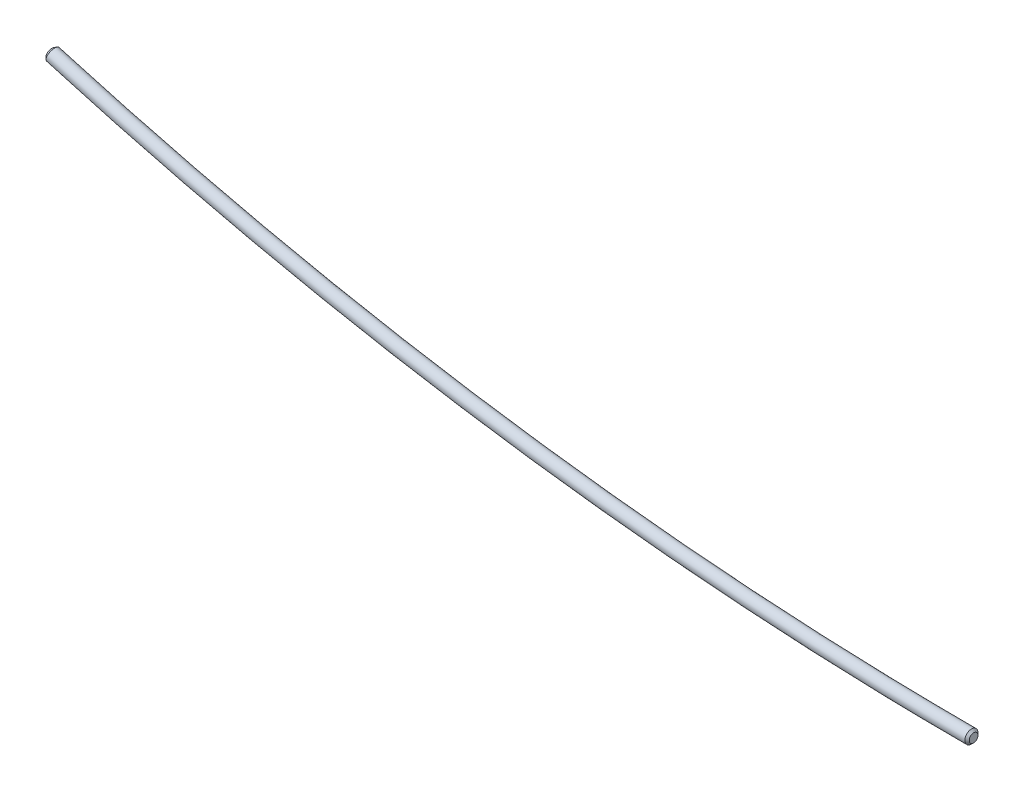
ISO-10303-21;
HEADER;
FILE_DESCRIPTION(('STEP AP214'),'2;1');
FILE_NAME('part.step','',(''),(''),'','','');
FILE_SCHEMA(('AUTOMOTIVE_DESIGN { 1 0 10303 214 1 1 1 1 }'));
ENDSEC;
DATA;
#1=APPLICATION_CONTEXT('core data for automotive mechanical design processes');
#2=APPLICATION_PROTOCOL_DEFINITION('international standard','automotive_design',2000,#1);
#3=PRODUCT_CONTEXT('',#1,'mechanical');
#4=PRODUCT('Part','Part','',(#3));
#5=PRODUCT_RELATED_PRODUCT_CATEGORY('part','',(#4));
#6=PRODUCT_DEFINITION_FORMATION('','',#4);
#7=PRODUCT_DEFINITION_CONTEXT('part definition',#1,'design');
#8=PRODUCT_DEFINITION('design','',#6,#7);
#9=PRODUCT_DEFINITION_SHAPE('','',#8);
#10=(LENGTH_UNIT() NAMED_UNIT(*) SI_UNIT(.MILLI.,.METRE.));
#11=(NAMED_UNIT(*) PLANE_ANGLE_UNIT() SI_UNIT($,.RADIAN.));
#12=(NAMED_UNIT(*) SI_UNIT($,.STERADIAN.) SOLID_ANGLE_UNIT());
#13=UNCERTAINTY_MEASURE_WITH_UNIT(LENGTH_MEASURE(1.E-05),#10,'distance_accuracy_value','');
#14=(GEOMETRIC_REPRESENTATION_CONTEXT(3) GLOBAL_UNCERTAINTY_ASSIGNED_CONTEXT((#13)) GLOBAL_UNIT_ASSIGNED_CONTEXT((#10,
#11,#12)) REPRESENTATION_CONTEXT('',''));
#15=CARTESIAN_POINT('',(0.,0.,0.));
#16=DIRECTION('',(0.,0.,1.));
#17=DIRECTION('',(1.,0.,0.));
#18=AXIS2_PLACEMENT_3D('',#15,#16,#17);
#19=CARTESIAN_POINT('',(0.,1503.3683132,0.));
#20=DIRECTION('',(0.,0.,1.));
#21=DIRECTION('',(1.,0.,0.));
#22=AXIS2_PLACEMENT_3D('',#19,#20,#21);
#23=TOROIDAL_SURFACE('',#22,1503.3683132,3.);
#24=CARTESIAN_POINT('',(-420.985678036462,60.1466240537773,-2.99999995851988));
#25=CARTESIAN_POINT('',(-420.999448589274,60.0994936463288,-3.00002712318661));
#26=CARTESIAN_POINT('',(-421.013218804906,60.0523643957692,-2.9987931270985));
#27=CARTESIAN_POINT('',(-421.040712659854,59.958265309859,-2.99384442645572));
#28=CARTESIAN_POINT('',(-421.054436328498,59.9112953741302,-2.99013179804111));
#29=CARTESIAN_POINT('',(-421.081807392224,59.817616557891,-2.98026986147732));
#30=CARTESIAN_POINT('',(-421.095454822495,59.7709075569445,-2.97412179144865));
#31=CARTESIAN_POINT('',(-421.122644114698,59.6778508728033,-2.95943368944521));
#32=CARTESIAN_POINT('',(-421.13618600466,59.6315030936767,-2.95089431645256));
#33=CARTESIAN_POINT('',(-421.16313482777,59.5392694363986,-2.93146780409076));
#34=CARTESIAN_POINT('',(-421.176541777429,59.4933835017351,-2.92058095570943));
#35=CARTESIAN_POINT('',(-421.203191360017,59.4021740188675,-2.89650355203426));
#36=CARTESIAN_POINT('',(-421.216433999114,59.35685044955,-2.88331308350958));
#37=CARTESIAN_POINT('',(-421.242725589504,59.2668662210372,-2.85467231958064));
#38=CARTESIAN_POINT('',(-421.255774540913,59.2222055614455,-2.83922202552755));
#39=CARTESIAN_POINT('',(-421.281649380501,59.1336476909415,-2.80610537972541));
#40=CARTESIAN_POINT('',(-421.294475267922,59.0897504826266,-2.78843902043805));
#41=CARTESIAN_POINT('',(-421.319874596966,59.0028200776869,-2.75093393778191));
#42=CARTESIAN_POINT('',(-421.332448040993,58.9597868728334,-2.7310952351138));
#43=CARTESIAN_POINT('',(-421.357313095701,58.8746850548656,-2.68928912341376));
#44=CARTESIAN_POINT('',(-421.36960471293,58.8326164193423,-2.66732176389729));
#45=CARTESIAN_POINT('',(-421.393876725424,58.7495443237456,-2.62130199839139));
#46=CARTESIAN_POINT('',(-421.405857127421,58.7085408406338,-2.59724963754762));
#47=CARTESIAN_POINT('',(-421.429477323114,58.6276996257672,-2.54710355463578));
#48=CARTESIAN_POINT('',(-421.441117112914,58.5878619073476,-2.5210098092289));
#49=CARTESIAN_POINT('',(-421.464026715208,58.5094527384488,-2.46682473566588));
#50=CARTESIAN_POINT('',(-421.475296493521,58.470881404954,-2.43873322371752));
#51=CARTESIAN_POINT('',(-421.497436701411,58.3951055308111,-2.38059637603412));
#52=CARTESIAN_POINT('',(-421.50830703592,58.3579013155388,-2.3505505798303));
#53=CARTESIAN_POINT('',(-421.529619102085,58.2849598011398,-2.28854944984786));
#54=CARTESIAN_POINT('',(-421.540060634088,58.2492231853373,-2.25659324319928));
#55=CARTESIAN_POINT('',(-421.560485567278,58.1793179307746,-2.19081417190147));
#56=CARTESIAN_POINT('',(-421.570468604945,58.1451505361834,-2.15698987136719));
#57=CARTESIAN_POINT('',(-421.589937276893,58.0785181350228,-2.0875626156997));
#58=CARTESIAN_POINT('',(-421.599422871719,58.0460532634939,-2.05195951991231));
#59=CARTESIAN_POINT('',(-421.617873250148,57.9829060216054,-1.97911937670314));
#60=CARTESIAN_POINT('',(-421.626838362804,57.9522225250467,-1.94188338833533));
#61=CARTESIAN_POINT('',(-421.644235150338,57.8926812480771,-1.86588133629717));
#62=CARTESIAN_POINT('',(-421.652667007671,57.8638228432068,-1.82711580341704));
#63=CARTESIAN_POINT('',(-421.668984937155,57.8079740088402,-1.74815977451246));
#64=CARTESIAN_POINT('',(-421.676871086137,57.7809833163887,-1.70796948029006));
#65=CARTESIAN_POINT('',(-421.692085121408,57.7289126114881,-1.62626845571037));
#66=CARTESIAN_POINT('',(-421.69941301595,57.7038325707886,-1.58475774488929));
#67=CARTESIAN_POINT('',(-421.713498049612,57.6556259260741,-1.50052038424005));
#68=CARTESIAN_POINT('',(-421.720255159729,57.6324994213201,-1.457793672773));
#69=CARTESIAN_POINT('',(-421.733186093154,57.5882427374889,-1.37122868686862));
#70=CARTESIAN_POINT('',(-421.739359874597,57.5671127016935,-1.32739033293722));
#71=CARTESIAN_POINT('',(-421.751111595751,57.5268919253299,-1.23870638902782));
#72=CARTESIAN_POINT('',(-421.756689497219,57.5078013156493,-1.19386073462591));
#73=CARTESIAN_POINT('',(-421.767236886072,57.4717024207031,-1.10326648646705));
#74=CARTESIAN_POINT('',(-421.77220634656,57.4546942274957,-1.05751785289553));
#75=CARTESIAN_POINT('',(-421.781524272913,57.4228032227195,-0.965221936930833));
#76=CARTESIAN_POINT('',(-421.785872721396,57.4079204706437,-0.918674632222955));
#77=CARTESIAN_POINT('',(-421.79393604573,57.3803233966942,-0.824885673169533));
#78=CARTESIAN_POINT('',(-421.797650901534,57.3676091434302,-0.777643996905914));
#79=CARTESIAN_POINT('',(-421.80443447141,57.3443920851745,-0.682570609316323));
#80=CARTESIAN_POINT('',(-421.80750313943,57.3338894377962,-0.634738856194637));
#81=CARTESIAN_POINT('',(-421.812981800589,57.3151384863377,-0.538589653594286));
#82=CARTESIAN_POINT('',(-421.815391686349,57.306890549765,-0.490272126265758));
#83=CARTESIAN_POINT('',(-421.819540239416,57.2926919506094,-0.393255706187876));
#84=CARTESIAN_POINT('',(-421.82127868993,57.2867420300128,-0.344556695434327));
#85=CARTESIAN_POINT('',(-421.824072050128,57.2771816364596,-0.246881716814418));
#86=CARTESIAN_POINT('',(-421.825126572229,57.2735724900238,-0.197905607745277));
#87=CARTESIAN_POINT('',(-421.82653917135,57.2687378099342,-0.0997805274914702));
#88=CARTESIAN_POINT('',(-421.826896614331,57.267514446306,-0.0506314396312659));
#89=CARTESIAN_POINT('',(-421.826904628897,57.267487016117,0.0476692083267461));
#90=CARTESIAN_POINT('',(-421.826555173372,57.2686830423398,0.0968207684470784));
#91=CARTESIAN_POINT('',(-421.825161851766,57.2734517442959,0.194955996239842));
#92=CARTESIAN_POINT('',(-421.82411857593,57.2770223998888,0.243939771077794));
#93=CARTESIAN_POINT('',(-421.821349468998,57.2864997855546,0.34163490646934));
#94=CARTESIAN_POINT('',(-421.819623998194,57.29240528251,0.390346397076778));
#95=CARTESIAN_POINT('',(-421.815502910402,57.3065098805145,0.48739228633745));
#96=CARTESIAN_POINT('',(-421.813107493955,57.3147082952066,0.535726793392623));
#97=CARTESIAN_POINT('',(-421.807658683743,57.3333570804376,0.631914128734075));
#98=CARTESIAN_POINT('',(-421.804605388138,57.3438071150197,0.679767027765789));
#99=CARTESIAN_POINT('',(-421.797852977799,57.3669175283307,0.774886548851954));
#100=CARTESIAN_POINT('',(-421.79415390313,57.3795777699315,0.822153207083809));
#101=CARTESIAN_POINT('',(-421.786122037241,57.4070671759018,0.915995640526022));
#102=CARTESIAN_POINT('',(-421.781789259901,57.4218962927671,0.962571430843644));
#103=CARTESIAN_POINT('',(-421.772502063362,57.4536821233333,1.05492750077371));
#104=CARTESIAN_POINT('',(-421.767547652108,57.4706388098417,1.10070779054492));
#105=CARTESIAN_POINT('',(-421.75702924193,57.5066385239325,1.19136821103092));
#106=CARTESIAN_POINT('',(-421.751465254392,57.5256815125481,1.23624835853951));
#107=CARTESIAN_POINT('',(-421.739739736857,57.5658126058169,1.32500383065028));
#108=CARTESIAN_POINT('',(-421.733578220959,57.5869006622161,1.36887917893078));
#109=CARTESIAN_POINT('',(-421.720669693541,57.6310806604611,1.45552038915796));
#110=CARTESIAN_POINT('',(-421.713922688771,57.6541725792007,1.49828626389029));
#111=CARTESIAN_POINT('',(-421.699855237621,57.7023190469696,1.58260387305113));
#112=CARTESIAN_POINT('',(-421.692534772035,57.7273736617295,1.62415556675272));
#113=CARTESIAN_POINT('',(-421.677332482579,57.7794041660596,1.70594023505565));
#114=CARTESIAN_POINT('',(-421.669450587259,57.806380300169,1.74617304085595));
#115=CARTESIAN_POINT('',(-421.653137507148,57.8622125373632,1.82521531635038));
#116=CARTESIAN_POINT('',(-421.644706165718,57.8910691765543,1.86402437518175));
#117=CARTESIAN_POINT('',(-421.627306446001,57.9506204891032,1.94011509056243));
#118=CARTESIAN_POINT('',(-421.61833778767,57.9813161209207,1.97739593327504));
#119=CARTESIAN_POINT('',(-421.599875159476,58.0445052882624,2.05032470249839));
#120=CARTESIAN_POINT('',(-421.59038074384,58.0770003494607,2.08597119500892));
#121=CARTESIAN_POINT('',(-421.57089333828,58.1436968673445,2.15548613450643));
#122=CARTESIAN_POINT('',(-421.560900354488,58.1778983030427,2.18935460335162));
#123=CARTESIAN_POINT('',(-421.540457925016,58.2478634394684,2.25522447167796));
#124=CARTESIAN_POINT('',(-421.530008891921,58.2836257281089,2.28722749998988));
#125=CARTESIAN_POINT('',(-421.508682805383,58.3566152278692,2.34932171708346));
#126=CARTESIAN_POINT('',(-421.497805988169,58.3938416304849,2.37941393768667));
#127=CARTESIAN_POINT('',(-421.475653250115,58.4696603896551,2.43764327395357));
#128=CARTESIAN_POINT('',(-421.464377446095,58.508252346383,2.46578095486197));
#129=CARTESIAN_POINT('',(-421.441455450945,58.5867039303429,2.52005736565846));
#130=CARTESIAN_POINT('',(-421.429809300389,58.6265634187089,2.5461963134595));
#131=CARTESIAN_POINT('',(-421.406175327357,58.707451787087,2.59643140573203));
#132=CARTESIAN_POINT('',(-421.394187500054,58.7484806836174,2.62052752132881));
#133=CARTESIAN_POINT('',(-421.36989884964,58.831609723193,2.66663296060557));
#134=CARTESIAN_POINT('',(-421.357597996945,58.873709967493,2.68864208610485));
#135=CARTESIAN_POINT('',(-421.332711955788,58.9588836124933,2.73052948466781));
#136=CARTESIAN_POINT('',(-421.320126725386,59.0019571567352,2.75040744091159));
#137=CARTESIAN_POINT('',(-421.294700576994,59.0889793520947,2.78798838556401));
#138=CARTESIAN_POINT('',(-421.281859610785,59.1329281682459,2.80569095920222));
#139=CARTESIAN_POINT('',(-421.255950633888,59.2216028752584,2.83887700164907));
#140=CARTESIAN_POINT('',(-421.242882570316,59.2663289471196,2.85435994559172));
#141=CARTESIAN_POINT('',(-421.216548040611,59.3564601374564,2.88306260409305));
#142=CARTESIAN_POINT('',(-421.203281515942,59.4018654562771,2.89628163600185));
#143=CARTESIAN_POINT('',(-421.176578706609,59.4932571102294,2.92041238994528));
#144=CARTESIAN_POINT('',(-421.163142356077,59.5392436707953,2.93132318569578));
#145=CARTESIAN_POINT('',(-421.136128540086,59.6316997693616,2.95079348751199));
#146=CARTESIAN_POINT('',(-421.122551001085,59.6781695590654,2.95935169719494));
#147=CARTESIAN_POINT('',(-421.095283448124,59.771494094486,2.97407292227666));
#148=CARTESIAN_POINT('',(-421.081593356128,59.8183491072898,2.98023410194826));
#149=CARTESIAN_POINT('',(-421.054129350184,59.9123460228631,2.99011773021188));
#150=CARTESIAN_POINT('',(-421.040355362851,59.9594881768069,2.99383759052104));
#151=CARTESIAN_POINT('',(-421.012752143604,60.0539615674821,2.99879452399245));
#152=CARTESIAN_POINT('',(-420.998922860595,60.1012929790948,3.00002799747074));
#153=CARTESIAN_POINT('',(-420.971266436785,60.195948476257,2.99997116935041));
#154=CARTESIAN_POINT('',(-420.95743929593,60.2432725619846,2.9986811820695));
#155=CARTESIAN_POINT('',(-420.929844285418,60.3377178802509,2.99361536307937));
#156=CARTESIAN_POINT('',(-420.916076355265,60.3848393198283,2.9898437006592));
#157=CARTESIAN_POINT('',(-420.888627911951,60.4787830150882,2.97985990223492));
#158=CARTESIAN_POINT('',(-420.874947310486,60.5256055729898,2.97365084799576));
#159=CARTESIAN_POINT('',(-420.84770170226,60.6188550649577,2.95883804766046));
#160=CARTESIAN_POINT('',(-420.834136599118,60.665282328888,2.95023655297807));
#161=CARTESIAN_POINT('',(-420.80715013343,60.7576449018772,2.93068420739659));
#162=CARTESIAN_POINT('',(-420.793728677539,60.8035805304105,2.91973499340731));
#163=CARTESIAN_POINT('',(-420.767057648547,60.8948635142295,2.89553238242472));
#164=CARTESIAN_POINT('',(-420.753807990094,60.9402111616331,2.88228018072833));
#165=CARTESIAN_POINT('',(-420.727508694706,61.0302218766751,2.85351658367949));
#166=CARTESIAN_POINT('',(-420.714458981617,61.0748852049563,2.83800607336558));
#167=CARTESIAN_POINT('',(-420.688587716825,61.1634309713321,2.80477072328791));
#168=CARTESIAN_POINT('',(-420.675766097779,61.207313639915,2.78704654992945));
#169=CARTESIAN_POINT('',(-420.650379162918,61.2942017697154,2.74942864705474));
#170=CARTESIAN_POINT('',(-420.637813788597,61.3372074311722,2.72953541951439));
#171=CARTESIAN_POINT('',(-420.6129674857,61.422245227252,2.68762413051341));
#172=CARTESIAN_POINT('',(-420.600686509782,61.464277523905,2.66560642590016));
#173=CARTESIAN_POINT('',(-420.576437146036,61.5472722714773,2.61949088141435));
#174=CARTESIAN_POINT('',(-420.564468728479,61.5882348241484,2.59539324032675));
#175=CARTESIAN_POINT('',(-420.54087261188,61.6689938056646,2.54516255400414));
#176=CARTESIAN_POINT('',(-420.529244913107,61.70879023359,2.51902950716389));
#177=CARTESIAN_POINT('',(-420.506358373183,61.7871206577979,2.46477271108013));
#178=CARTESIAN_POINT('',(-420.49509958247,61.8256544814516,2.4366486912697));
#179=CARTESIAN_POINT('',(-420.472978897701,61.9013637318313,2.37845498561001));
#180=CARTESIAN_POINT('',(-420.462117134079,61.9385387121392,2.34838466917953));
#181=CARTESIAN_POINT('',(-420.440818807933,62.011433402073,2.28634250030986));
#182=CARTESIAN_POINT('',(-420.430382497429,62.047152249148,2.25436954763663));
#183=CARTESIAN_POINT('',(-420.40996223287,62.1170417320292,2.18857006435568));
#184=CARTESIAN_POINT('',(-420.399978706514,62.1512109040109,2.15474184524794));
#185=CARTESIAN_POINT('',(-420.380507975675,62.2178505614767,2.0853114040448));
#186=CARTESIAN_POINT('',(-420.371020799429,62.2503209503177,2.04970908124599));
#187=CARTESIAN_POINT('',(-420.352572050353,62.3134628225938,1.97686647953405));
#188=CARTESIAN_POINT('',(-420.343610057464,62.3441357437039,1.93962755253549));
#189=CARTESIAN_POINT('',(-420.326222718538,62.4036448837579,1.86362036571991));
#190=CARTESIAN_POINT('',(-420.317797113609,62.4324819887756,1.82485285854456));
#191=CARTESIAN_POINT('',(-420.301494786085,62.4882776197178,1.74589323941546));
#192=CARTESIAN_POINT('',(-420.293617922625,62.5152366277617,1.70570149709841));
#193=CARTESIAN_POINT('',(-420.278425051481,62.5672350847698,1.62399890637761));
#194=CARTESIAN_POINT('',(-420.271108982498,62.5922747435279,1.58248820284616));
#195=CARTESIAN_POINT('',(-420.257049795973,62.6403931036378,1.49825278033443));
#196=CARTESIAN_POINT('',(-420.250306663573,62.6634718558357,1.45552809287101));
#197=CARTESIAN_POINT('',(-420.237405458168,62.7076269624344,1.36896976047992));
#198=CARTESIAN_POINT('',(-420.231247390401,62.7287032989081,1.32513610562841));
#199=CARTESIAN_POINT('',(-420.219528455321,62.7688120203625,1.23646481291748));
#200=CARTESIAN_POINT('',(-420.213967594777,62.7878443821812,1.1916271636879));
#201=CARTESIAN_POINT('',(-420.203455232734,62.8238235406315,1.10105282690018));
#202=CARTESIAN_POINT('',(-420.198503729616,62.8407703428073,1.0553161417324));
#203=CARTESIAN_POINT('',(-420.189222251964,62.872536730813,0.963048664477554));
#204=CARTESIAN_POINT('',(-420.184892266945,62.88735635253,0.916517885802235));
#205=CARTESIAN_POINT('',(-420.176865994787,62.9148267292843,0.822767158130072));
#206=CARTESIAN_POINT('',(-420.173169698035,62.9274775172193,0.775547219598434));
#207=CARTESIAN_POINT('',(-420.166422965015,62.9505685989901,0.680523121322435));
#208=CARTESIAN_POINT('',(-420.163372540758,62.9610088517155,0.63271895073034));
#209=CARTESIAN_POINT('',(-420.157929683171,62.9796373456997,0.536631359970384));
#210=CARTESIAN_POINT('',(-420.155537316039,62.9878253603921,0.488347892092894));
#211=CARTESIAN_POINT('',(-420.151422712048,63.0019078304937,0.391406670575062));
#212=CARTESIAN_POINT('',(-420.149700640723,63.0078017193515,0.342748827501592));
#213=CARTESIAN_POINT('',(-420.146938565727,63.0172550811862,0.245163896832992));
#214=CARTESIAN_POINT('',(-420.145898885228,63.0208134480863,0.196236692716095));
#215=CARTESIAN_POINT('',(-420.144514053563,63.0255531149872,0.0982177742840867));
#216=CARTESIAN_POINT('',(-420.144169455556,63.0267325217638,0.0491259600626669));
#217=CARTESIAN_POINT('',(-420.144184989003,63.0266793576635,-0.0490604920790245));
#218=CARTESIAN_POINT('',(-420.144545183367,63.025446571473,-0.0981551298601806));
#219=CARTESIAN_POINT('',(-420.145957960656,63.020611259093,-0.196185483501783));
#220=CARTESIAN_POINT('',(-420.147010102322,63.0170102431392,-0.245121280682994));
#221=CARTESIAN_POINT('',(-420.149795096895,63.0074784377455,-0.342728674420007));
#222=CARTESIAN_POINT('',(-420.151527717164,63.0015484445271,-0.391400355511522));
#223=CARTESIAN_POINT('',(-420.15566149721,62.9874003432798,-0.488374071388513));
#224=CARTESIAN_POINT('',(-420.158062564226,62.9791825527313,-0.536676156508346));
#225=CARTESIAN_POINT('',(-420.163521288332,62.9604997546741,-0.632805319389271));
#226=CARTESIAN_POINT('',(-420.166578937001,62.950034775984,-0.680632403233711));
#227=CARTESIAN_POINT('',(-420.173338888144,62.9268984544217,-0.775706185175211));
#228=CARTESIAN_POINT('',(-420.177041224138,62.9142269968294,-0.822952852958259));
#229=CARTESIAN_POINT('',(-420.185078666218,62.8867183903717,-0.916760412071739));
#230=CARTESIAN_POINT('',(-420.189413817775,62.8718810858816,-0.963321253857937));
#231=CARTESIAN_POINT('',(-420.198705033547,62.8400813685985,-1.05565174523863));
#232=CARTESIAN_POINT('',(-420.20366113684,62.823118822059,-1.10142134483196));
#233=CARTESIAN_POINT('',(-420.21418241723,62.7871091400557,-1.19206391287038));
#234=CARTESIAN_POINT('',(-420.219747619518,62.7680619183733,-1.23693684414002));
#235=CARTESIAN_POINT('',(-420.231475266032,62.7279233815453,-1.32568062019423));
#236=CARTESIAN_POINT('',(-420.23763772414,62.706832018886,-1.36955144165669));
#237=CARTESIAN_POINT('',(-420.250548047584,62.6626457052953,-1.45618554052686));
#238=CARTESIAN_POINT('',(-420.257295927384,62.6395507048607,-1.49894879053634));
#239=CARTESIAN_POINT('',(-420.271365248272,62.5913976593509,-1.58326230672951));
#240=CARTESIAN_POINT('',(-420.278686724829,62.5663394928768,-1.62481249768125));
#241=CARTESIAN_POINT('',(-420.293891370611,62.5143007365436,-1.70659450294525));
#242=CARTESIAN_POINT('',(-420.301774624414,62.4873198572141,-1.74682611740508));
#243=CARTESIAN_POINT('',(-420.31809093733,62.4314763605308,-1.82586565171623));
#244=CARTESIAN_POINT('',(-420.326524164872,62.4026131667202,-1.86467312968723));
#245=CARTESIAN_POINT('',(-420.343928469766,62.3430459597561,-1.94075921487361));
#246=CARTESIAN_POINT('',(-420.352899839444,62.3123409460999,-1.97803697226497));
#247=CARTESIAN_POINT('',(-420.371368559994,62.2491307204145,-2.05095853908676));
#248=CARTESIAN_POINT('',(-420.380866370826,62.2166239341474,-2.08660086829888));
#249=CARTESIAN_POINT('',(-420.400362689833,62.149896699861,-2.1561010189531));
#250=CARTESIAN_POINT('',(-420.410361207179,62.1156762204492,-2.18995880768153));
#251=CARTESIAN_POINT('',(-420.430817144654,62.0456646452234,-2.25579787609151));
#252=CARTESIAN_POINT('',(-420.441274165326,62.0098749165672,-2.28778073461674));
#253=CARTESIAN_POINT('',(-420.462617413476,61.9368264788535,-2.34982819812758));
#254=CARTESIAN_POINT('',(-420.473503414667,61.8995685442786,-2.37989379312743));
#255=CARTESIAN_POINT('',(-420.495674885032,61.8236854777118,-2.43806487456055));
#256=CARTESIAN_POINT('',(-420.506960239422,61.7850607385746,-2.46617091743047));
#257=CARTESIAN_POINT('',(-420.52990076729,61.7065455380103,-2.52038086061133));
#258=CARTESIAN_POINT('',(-420.541555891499,61.6666552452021,-2.54648502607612));
#259=CARTESIAN_POINT('',(-420.56520634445,61.5857102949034,-2.59664903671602));
#260=CARTESIAN_POINT('',(-420.57720165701,61.5446556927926,-2.62070897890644));
#261=CARTESIAN_POINT('',(-420.601502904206,61.461483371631,-2.6667422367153));
#262=CARTESIAN_POINT('',(-420.613808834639,61.4193656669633,-2.68871558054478));
#263=CARTESIAN_POINT('',(-420.63870175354,61.3341683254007,-2.73053323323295));
#264=CARTESIAN_POINT('',(-420.651288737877,61.2910887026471,-2.75037757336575));
#265=CARTESIAN_POINT('',(-420.67671421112,61.2040686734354,-2.78789473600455));
#266=CARTESIAN_POINT('',(-420.689552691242,61.1601282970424,-2.80556763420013));
#267=CARTESIAN_POINT('',(-420.715451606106,61.0714878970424,-2.83869938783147));
#268=CARTESIAN_POINT('',(-420.728512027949,61.0267879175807,-2.85415837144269));
#269=CARTESIAN_POINT('',(-420.754825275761,60.9367294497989,-2.88281976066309));
#270=CARTESIAN_POINT('',(-420.76807808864,60.8913710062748,-2.89602231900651));
#271=CARTESIAN_POINT('',(-420.794746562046,60.8000967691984,-2.92012835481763));
#272=CARTESIAN_POINT('',(-420.808162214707,60.7541810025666,-2.93103194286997));
#273=CARTESIAN_POINT('',(-420.835126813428,60.6618932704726,-2.95049758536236));
#274=CARTESIAN_POINT('',(-420.848675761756,60.6155212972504,-2.95905959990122));
#275=CARTESIAN_POINT('',(-420.875877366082,60.5224224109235,-2.97379981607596));
#276=CARTESIAN_POINT('',(-420.889530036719,60.4756954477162,-2.97997767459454));
#277=CARTESIAN_POINT('',(-420.91690960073,60.3819874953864,-2.98990721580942));
#278=CARTESIAN_POINT('',(-420.930636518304,60.3350064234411,-2.993658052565));
#279=CARTESIAN_POINT('',(-420.958134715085,60.2408924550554,-2.9986922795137));
#280=CARTESIAN_POINT('',(-420.97190601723,60.1937594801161,-2.99997407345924));
#281=CARTESIAN_POINT('',(-420.985678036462,60.1466240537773,-2.99999995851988));
#282=B_SPLINE_CURVE_WITH_KNOTS('',3,(#24,#25,#26,#27,#28,#29,#30,#31,#32,#33,#34,#35,#36,#37,
#38,#39,#40,#41,#42,#43,#44,#45,#46,#47,#48,#49,#50,#51,#52,#53,#54,#55,#56,#57,#58,#59,#60,#61,
#62,#63,#64,#65,#66,#67,#68,#69,#70,#71,#72,#73,#74,#75,#76,#77,#78,#79,#80,#81,#82,#83,#84,#85,
#86,#87,#88,#89,#90,#91,#92,#93,#94,#95,#96,#97,#98,#99,#100,#101,#102,#103,#104,#105,#106,#107,
#108,#109,#110,#111,#112,#113,#114,#115,#116,#117,#118,#119,#120,#121,#122,#123,#124,#125,#126,
#127,#128,#129,#130,#131,#132,#133,#134,#135,#136,#137,#138,#139,#140,#141,#142,#143,#144,#145,
#146,#147,#148,#149,#150,#151,#152,#153,#154,#155,#156,#157,#158,#159,#160,#161,#162,#163,#164,
#165,#166,#167,#168,#169,#170,#171,#172,#173,#174,#175,#176,#177,#178,#179,#180,#181,#182,#183,
#184,#185,#186,#187,#188,#189,#190,#191,#192,#193,#194,#195,#196,#197,#198,#199,#200,#201,#202,
#203,#204,#205,#206,#207,#208,#209,#210,#211,#212,#213,#214,#215,#216,#217,#218,#219,#220,#221,
#222,#223,#224,#225,#226,#227,#228,#229,#230,#231,#232,#233,#234,#235,#236,#237,#238,#239,#240,
#241,#242,#243,#244,#245,#246,#247,#248,#249,#250,#251,#252,#253,#254,#255,#256,#257,#258,#259,
#260,#261,#262,#263,#264,#265,#266,#267,#268,#269,#270,#271,#272,#273,#274,#275,#276,#277,#278,
#279,#280,#281),.UNSPECIFIED.,.F.,.F.,(4,2,2,2,2,2,2,2,2,2,2,2,2,2,2,2,2,2,2,2,2,2,2,2,2,2,2,2,
2,2,2,2,2,2,2,2,2,2,2,2,2,2,2,2,2,2,2,2,2,2,2,2,2,2,2,2,2,2,2,2,2,2,2,2,2,2,2,2,2,2,2,2,2,2,2,2,
2,2,2,2,2,2,2,2,2,2,2,2,2,2,2,2,2,2,2,2,2,2,2,2,2,2,2,2,2,2,2,2,2,2,2,2,2,2,2,2,2,2,2,2,2,2,2,2,
2,2,2,2,4),(0.,0.147283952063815,0.294444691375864,0.44153071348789,0.588576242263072,
0.735603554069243,0.882625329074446,1.02964701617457,1.17666920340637,1.32368998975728,
1.47070735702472,1.61772154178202,1.76473740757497,1.91176681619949,2.05883099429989,
2.20596288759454,2.35320948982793,2.5004677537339,2.64763188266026,2.7947453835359,
2.94183812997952,3.08892870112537,3.2360267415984,3.38313533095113,3.53025335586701,
3.67737788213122,3.82450652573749,3.97163982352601,4.11878360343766,4.26595135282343,
4.41316658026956,4.56046516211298,4.70789765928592,4.85533581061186,5.00264869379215,
5.14988387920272,5.2970750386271,5.4442442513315,5.59140433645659,5.73856119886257,
5.88571618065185,6.03286841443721,6.18001717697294,6.32716424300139,6.47431623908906,
6.62148699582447,6.76869989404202,6.91599019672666,7.06340735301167,7.21082269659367,
7.35810733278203,7.50531174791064,7.65247341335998,7.79961901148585,7.94676668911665,
8.09392832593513,8.2411118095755,8.38832331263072,8.53556956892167,8.68286014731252,
8.83020972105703,8.97764032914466,9.12518362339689,9.27288309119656,9.4207962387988,
9.56869096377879,9.71633785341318,9.86379866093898,10.0111211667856,10.1583412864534,
10.3054852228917,10.4525716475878,10.5996138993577,10.7466221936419,10.8936058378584,
11.0405754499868,11.1875451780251,11.3345349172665,11.4815725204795,11.6286959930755,
11.7759556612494,11.9232236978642,12.0703722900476,12.2174493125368,12.3644884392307,
12.5115114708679,12.6585306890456,12.8055512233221,12.9525734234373,13.099595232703,
13.2466145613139,13.3936316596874,13.5406514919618,13.6876861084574,13.8347570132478,
13.9818975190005,14.1291550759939,14.276425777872,14.4236026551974,14.5707292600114,
14.7178354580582,14.8649397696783,15.0120517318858,15.159174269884,15.3063060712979,
15.4534439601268,15.600585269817,15.7477302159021,15.8948842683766,16.0420605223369,
16.1892820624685,16.3365843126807,16.4840173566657,16.6314531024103,16.7787628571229,
16.9259959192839,17.073187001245,17.2203585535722,17.3675231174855,17.5146856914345,
17.6618461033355,17.8090013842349,17.9561481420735,18.1032849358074,18.2504146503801,
18.3975468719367,18.5447002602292,18.6919049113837,18.8392046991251),.UNSPECIFIED.);
#283=CARTESIAN_POINT('',(-420.985678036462,60.1466240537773,-2.99999995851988));
#284=VERTEX_POINT('',#283);
#285=EDGE_CURVE('E46',#284,#284,#282,.F.);
#286=ORIENTED_EDGE('',*,*,#285,.T.);
#287=EDGE_LOOP('',(#286));
#288=FACE_BOUND('',#287,.T.);
#289=CARTESIAN_POINT('',(-1.0000001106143,-0.00016629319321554,-2.99999995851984));
#290=CARTESIAN_POINT('',(-0.999825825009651,0.785881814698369,-3.00068971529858));
#291=CARTESIAN_POINT('',(-0.999653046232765,1.56420367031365,-2.67849154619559));
#292=CARTESIAN_POINT('',(-0.999406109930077,2.67577771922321,-1.56747132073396));
#293=CARTESIAN_POINT('',(-0.999334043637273,2.99987088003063,-0.789363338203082));
#294=CARTESIAN_POINT('',(-0.9993338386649,3.00079265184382,0.78436296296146));
#295=CARTESIAN_POINT('',(-0.999405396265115,2.67899079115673,1.56340334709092));
#296=CARTESIAN_POINT('',(-0.999652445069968,1.56690946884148,2.67664166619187));
#297=CARTESIAN_POINT('',(-0.999825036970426,0.789434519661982,3.00020138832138));
#298=CARTESIAN_POINT('',(-1.00017521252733,-0.789894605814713,2.99979850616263));
#299=CARTESIAN_POINT('',(-1.00034700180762,-1.56561253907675,2.67627267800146));
#300=CARTESIAN_POINT('',(-1.0005930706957,-2.67753772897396,1.5651932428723));
#301=CARTESIAN_POINT('',(-1.0006643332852,-2.99986651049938,0.786900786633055));
#302=CARTESIAN_POINT('',(-1.00066424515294,-2.99946840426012,-0.784837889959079));
#303=CARTESIAN_POINT('',(-1.00059316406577,-2.67795943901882,-1.56412690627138));
#304=CARTESIAN_POINT('',(-1.00034695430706,-1.56539810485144,-2.67713161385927));
#305=CARTESIAN_POINT('',(-1.00017439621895,-0.7862144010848,-2.99931020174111));
#306=CARTESIAN_POINT('',(-1.0000001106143,-0.000166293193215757,-2.99999995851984));
#307=B_SPLINE_CURVE_WITH_KNOTS('',3,(#289,#290,#291,#292,#293,#294,#295,#296,#297,#298,#299,
#300,#301,#302,#303,#304,#305,#306),.UNSPECIFIED.,.T.,.F.,(4,2,2,2,2,2,2,2,4),
(0.000208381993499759,0.00177143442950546,0.00333448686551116,0.00489753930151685,
0.00646059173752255,0.00802364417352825,0.00958669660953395,0.0111497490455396,
0.0127128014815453),.UNSPECIFIED.);
#308=CARTESIAN_POINT('',(-1.0000001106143,-0.00016629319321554,-2.99999995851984));
#309=VERTEX_POINT('',#308);
#310=EDGE_CURVE('E51',#309,#309,#307,.F.);
#311=ORIENTED_EDGE('',*,*,#310,.T.);
#312=EDGE_LOOP('',(#311));
#313=FACE_BOUND('',#312,.T.);
#314=ADVANCED_FACE('F32',(#288,#313),#23,.T.);
#315=CARTESIAN_POINT('',(-421.945436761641,60.4274504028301,0.));
#316=DIRECTION('',(0.959805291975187,-0.280666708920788,0.));
#317=DIRECTION('',(0.,0.,-1.));
#318=AXIS2_PLACEMENT_3D('',#315,#316,#317);
#319=PLANE('',#318);
#320=CARTESIAN_POINT('',(-421.945436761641,60.4274504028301,-1.99999997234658));
#321=CARTESIAN_POINT('',(-421.798360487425,60.9304120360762,-1.99971726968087));
#322=CARTESIAN_POINT('',(-421.652546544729,61.4290568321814,-1.78511412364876));
#323=CARTESIAN_POINT('',(-421.444306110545,62.1411835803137,-1.04335337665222));
#324=CARTESIAN_POINT('',(-421.384096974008,62.3470827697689,-0.523895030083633));
#325=CARTESIAN_POINT('',(-421.383922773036,62.3476784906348,0.523941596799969));
#326=CARTESIAN_POINT('',(-421.444188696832,62.1415851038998,1.0428710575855));
#327=CARTESIAN_POINT('',(-421.652169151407,61.430347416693,1.783832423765));
#328=CARTESIAN_POINT('',(-421.79729474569,60.9340565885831,1.99969118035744));
#329=CARTESIAN_POINT('',(-422.092799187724,59.9235102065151,2.0003082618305));
#330=CARTESIAN_POINT('',(-422.238301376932,59.4259315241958,1.78476741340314));
#331=CARTESIAN_POINT('',(-422.446452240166,58.7141110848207,1.04287109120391));
#332=CARTESIAN_POINT('',(-422.506715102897,58.5080281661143,0.523586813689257));
#333=CARTESIAN_POINT('',(-422.506638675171,58.5082895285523,-0.525562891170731));
#334=CARTESIAN_POINT('',(-422.446046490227,58.7154986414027,-1.04438315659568));
#335=CARTESIAN_POINT('',(-422.238127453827,59.4265262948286,-1.7853203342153));
#336=CARTESIAN_POINT('',(-422.092513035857,59.9244887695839,-2.00028267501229));
#337=CARTESIAN_POINT('',(-421.945436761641,60.4274504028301,-1.99999997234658));
#338=B_SPLINE_CURVE_WITH_KNOTS('',3,(#320,#321,#322,#323,#324,#325,#326,#327,#328,#329,#330,
#331,#332,#333,#334,#335,#336,#337),.UNSPECIFIED.,.T.,.F.,(4,2,2,2,2,2,2,2,4),
(-0.0122947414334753,-0.0107316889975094,-0.00916863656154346,-0.00760558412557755,
-0.00604253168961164,-0.00447947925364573,-0.00291642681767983,-0.00135337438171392,
0.000209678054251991),.UNSPECIFIED.);
#339=CARTESIAN_POINT('',(-421.945436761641,60.42745040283,-1.99999997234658));
#340=VERTEX_POINT('',#339);
#341=EDGE_CURVE('E42',#340,#340,#338,.F.);
#342=ORIENTED_EDGE('',*,*,#341,.T.);
#343=EDGE_LOOP('',(#342));
#344=FACE_BOUND('',#343,.T.);
#345=ADVANCED_FACE('F85',(#344),#319,.F.);
#346=CARTESIAN_POINT('',(0.,0.,0.));
#347=DIRECTION('',(1.,0.,0.));
#348=DIRECTION('',(0.,0.,-1.));
#349=AXIS2_PLACEMENT_3D('',#346,#347,#348);
#350=PLANE('',#349);
#351=CARTESIAN_POINT('',(0.,0.,-1.99999997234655));
#352=CARTESIAN_POINT('',(0.,-0.0327379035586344,-1.99997164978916));
#353=CARTESIAN_POINT('',(0.,-0.0654738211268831,-1.99910602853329));
#354=CARTESIAN_POINT('',(0.,-0.130839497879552,-1.99572768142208));
#355=CARTESIAN_POINT('',(0.,-0.163469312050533,-1.99321602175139));
#356=CARTESIAN_POINT('',(0.,-0.228551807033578,-1.98657414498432));
#357=CARTESIAN_POINT('',(0.,-0.261004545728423,-1.98244449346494));
#358=CARTESIAN_POINT('',(0.,-0.325662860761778,-1.97259557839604));
#359=CARTESIAN_POINT('',(0.,-0.357868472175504,-1.9668765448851));
#360=CARTESIAN_POINT('',(0.,-0.421962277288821,-1.9538774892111));
#361=CARTESIAN_POINT('',(0.,-0.453850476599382,-1.94659749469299));
#362=CARTESIAN_POINT('',(0.,-0.517239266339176,-1.93050505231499));
#363=CARTESIAN_POINT('',(0.,-0.548739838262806,-1.92169253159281));
#364=CARTESIAN_POINT('',(0.,-0.611283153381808,-1.90256346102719));
#365=CARTESIAN_POINT('',(0.,-0.642325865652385,-1.89224681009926));
#366=CARTESIAN_POINT('',(0.,-0.70388323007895,-1.87013783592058));
#367=CARTESIAN_POINT('',(0.,-0.734397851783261,-1.85834542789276));
#368=CARTESIAN_POINT('',(0.,-0.794828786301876,-1.83331325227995));
#369=CARTESIAN_POINT('',(0.,-0.824745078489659,-1.82007343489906));
#370=CARTESIAN_POINT('',(0.,-0.88390909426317,-1.79217473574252));
#371=CARTESIAN_POINT('',(0.,-0.91315680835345,-1.77751583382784));
#372=CARTESIAN_POINT('',(0.,-0.970913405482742,-1.7468072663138));
#373=CARTESIAN_POINT('',(0.,-0.999422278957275,-1.73075758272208));
#374=CARTESIAN_POINT('',(0.,-1.05563094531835,-1.69729578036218));
#375=CARTESIAN_POINT('',(0.,-1.08333070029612,-1.67988359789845));
#376=CARTESIAN_POINT('',(0.,-1.13785090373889,-1.64372517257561));
#377=CARTESIAN_POINT('',(0.,-1.16467123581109,-1.62497875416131));
#378=CARTESIAN_POINT('',(0.,-1.21736244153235,-1.58618030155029));
#379=CARTESIAN_POINT('',(0.,-1.24323304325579,-1.56612789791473));
#380=CARTESIAN_POINT('',(0.,-1.29395463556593,-1.52474598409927));
#381=CARTESIAN_POINT('',(0.,-1.31880508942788,-1.50341581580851));
#382=CARTESIAN_POINT('',(0.,-1.36741664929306,-1.4595070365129));
#383=CARTESIAN_POINT('',(0.,-1.39117680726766,-1.43692737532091));
#384=CARTESIAN_POINT('',(0.,-1.43750643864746,-1.39057878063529));
#385=CARTESIAN_POINT('',(0.,-1.46007593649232,-1.36680987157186));
#386=CARTESIAN_POINT('',(0.,-1.50396196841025,-1.31818119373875));
#387=CARTESIAN_POINT('',(0.,-1.52527959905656,-1.29332241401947));
#388=CARTESIAN_POINT('',(0.,-1.56663453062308,-1.24258491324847));
#389=CARTESIAN_POINT('',(0.,-1.58667252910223,-1.21670676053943));
#390=CARTESIAN_POINT('',(0.,-1.62544039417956,-1.16400118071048));
#391=CARTESIAN_POINT('',(0.,-1.64417066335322,-1.13717404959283));
#392=CARTESIAN_POINT('',(0.,-1.68029524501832,-1.08264105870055));
#393=CARTESIAN_POINT('',(0.,-1.6976897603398,-1.05493533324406));
#394=CARTESIAN_POINT('',(0.,-1.7311148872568,-0.99871559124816));
#395=CARTESIAN_POINT('',(0.,-1.74714558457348,-0.970201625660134));
#396=CARTESIAN_POINT('',(0.,-1.77781504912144,-0.912435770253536));
#397=CARTESIAN_POINT('',(0.,-1.79245385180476,-0.883183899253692));
#398=CARTESIAN_POINT('',(0.,-1.82031143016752,-0.824012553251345));
#399=CARTESIAN_POINT('',(0.,-1.83353023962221,-0.79409309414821));
#400=CARTESIAN_POINT('',(0.,-1.8585196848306,-0.733656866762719));
#401=CARTESIAN_POINT('',(0.,-1.87029038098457,-0.703140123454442));
#402=CARTESIAN_POINT('',(0.,-1.89235542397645,-0.641579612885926));
#403=CARTESIAN_POINT('',(0.,-1.90264986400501,-0.610535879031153));
#404=CARTESIAN_POINT('',(0.,-1.92173421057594,-0.547991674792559));
#405=CARTESIAN_POINT('',(0.,-1.93052422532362,-0.516491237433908));
#406=CARTESIAN_POINT('',(0.,-1.94657156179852,-0.453103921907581));
#407=CARTESIAN_POINT('',(0.,-1.95382896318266,-0.421217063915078));
#408=CARTESIAN_POINT('',(0.,-1.96678293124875,-0.357127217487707));
#409=CARTESIAN_POINT('',(0.,-1.97247947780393,-0.32492422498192));
#410=CARTESIAN_POINT('',(0.,-1.9822837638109,-0.260272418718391));
#411=CARTESIAN_POINT('',(0.,-1.98639128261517,-0.227823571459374));
#412=CARTESIAN_POINT('',(0.,-1.99298927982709,-0.162750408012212));
#413=CARTESIAN_POINT('',(0.,-1.99547920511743,-0.130126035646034));
#414=CARTESIAN_POINT('',(0.,-1.99881527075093,-0.0647720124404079));
#415=CARTESIAN_POINT('',(0.,-1.9996603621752,-0.0320423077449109));
#416=CARTESIAN_POINT('',(0.,-1.99967511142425,0.0334146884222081));
#417=CARTESIAN_POINT('',(0.,-1.9988449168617,0.0661419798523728));
#418=CARTESIAN_POINT('',(0.,-1.99553107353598,0.131486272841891));
#419=CARTESIAN_POINT('',(0.,-1.99304873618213,0.164103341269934));
#420=CARTESIAN_POINT('',(0.,-1.98646131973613,0.229157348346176));
#421=CARTESIAN_POINT('',(0.,-1.98235700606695,0.261594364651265));
#422=CARTESIAN_POINT('',(0.,-1.97255477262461,0.326218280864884));
#423=CARTESIAN_POINT('',(0.,-1.96685724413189,0.358405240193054));
#424=CARTESIAN_POINT('',(0.,-1.95389791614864,0.422459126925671));
#425=CARTESIAN_POINT('',(0.,-1.94663627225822,0.454326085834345));
#426=CARTESIAN_POINT('',(0.,-1.93057781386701,0.517670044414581));
#427=CARTESIAN_POINT('',(0.,-1.92178102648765,0.549147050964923));
#428=CARTESIAN_POINT('',(0.,-1.90268130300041,0.611641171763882));
#429=CARTESIAN_POINT('',(0.,-1.89237834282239,0.642658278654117));
#430=CARTESIAN_POINT('',(0.,-1.87029521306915,0.704162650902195));
#431=CARTESIAN_POINT('',(0.,-1.85851501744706,0.73464990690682));
#432=CARTESIAN_POINT('',(0.,-1.83350631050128,0.795024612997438));
#433=CARTESIAN_POINT('',(0.,-1.82027779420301,0.824912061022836));
#434=CARTESIAN_POINT('',(0.,-1.79240131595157,0.88401717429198));
#435=CARTESIAN_POINT('',(0.,-1.77775336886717,0.91323484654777));
#436=CARTESIAN_POINT('',(0.,-1.74706690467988,0.970930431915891));
#437=CARTESIAN_POINT('',(0.,-1.73102839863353,0.999408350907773));
#438=CARTESIAN_POINT('',(0.,-1.69758970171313,1.05555445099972));
#439=CARTESIAN_POINT('',(0.,-1.68018947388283,1.08322261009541));
#440=CARTESIAN_POINT('',(0.,-1.64405631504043,1.13767928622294));
#441=CARTESIAN_POINT('',(0.,-1.6253232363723,1.16446770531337));
#442=CARTESIAN_POINT('',(0.,-1.58655322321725,1.21709487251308));
#443=CARTESIAN_POINT('',(0.,-1.56651595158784,1.24293337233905));
#444=CARTESIAN_POINT('',(0.,-1.52516721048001,1.29359140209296));
#445=CARTESIAN_POINT('',(0.,-1.50385512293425,1.31841042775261));
#446=CARTESIAN_POINT('',(0.,-1.45998376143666,1.36695788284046));
#447=CARTESIAN_POINT('',(0.,-1.43742348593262,1.39068540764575));
#448=CARTESIAN_POINT('',(0.,-1.39112335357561,1.43695723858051));
#449=CARTESIAN_POINT('',(0.,-1.36738356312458,1.4595016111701));
#450=CARTESIAN_POINT('',(0.,-1.31882712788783,1.50335200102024));
#451=CARTESIAN_POINT('',(0.,-1.29401150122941,1.52465914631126));
#452=CARTESIAN_POINT('',(0.,-1.24336876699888,1.56600390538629));
#453=CARTESIAN_POINT('',(0.,-1.21754225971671,1.58604225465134));
#454=CARTESIAN_POINT('',(0.,-1.16494562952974,1.62482065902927));
#455=CARTESIAN_POINT('',(0.,-1.13817581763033,1.64356113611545));
#456=CARTESIAN_POINT('',(0.,-1.08375961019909,1.67971427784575));
#457=CARTESIAN_POINT('',(0.,-1.05611333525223,1.69712712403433));
#458=CARTESIAN_POINT('',(0.,-1.00001133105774,1.73059558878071));
#459=CARTESIAN_POINT('',(0.,-0.971555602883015,1.74665120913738));
#460=CARTESIAN_POINT('',(0.,-0.913901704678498,1.77737569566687));
#461=CARTESIAN_POINT('',(0.,-0.884703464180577,1.79204442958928));
#462=CARTESIAN_POINT('',(0.,-0.825631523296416,1.81996558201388));
#463=CARTESIAN_POINT('',(0.,-0.795757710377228,1.83321776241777));
#464=CARTESIAN_POINT('',(0.,-0.735401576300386,1.85827621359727));
#465=CARTESIAN_POINT('',(0.,-0.704919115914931,1.87008214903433));
#466=CARTESIAN_POINT('',(0.,-0.643412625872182,1.89221850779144));
#467=CARTESIAN_POINT('',(0.,-0.612388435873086,1.9025484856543));
#468=CARTESIAN_POINT('',(0.,-0.549865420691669,1.92170333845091));
#469=CARTESIAN_POINT('',(0.,-0.518366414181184,1.93052762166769));
#470=CARTESIAN_POINT('',(0.,-0.454960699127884,1.94664153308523));
#471=CARTESIAN_POINT('',(0.,-0.423053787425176,1.95393036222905));
#472=CARTESIAN_POINT('',(0.,-0.358899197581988,1.96694386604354));
#473=CARTESIAN_POINT('',(0.,-0.326651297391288,1.97266744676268));
#474=CARTESIAN_POINT('',(0.,-0.261881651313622,1.98252107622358));
#475=CARTESIAN_POINT('',(0.,-0.229359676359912,1.98664962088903));
#476=CARTESIAN_POINT('',(0.,-0.1641088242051,1.99328379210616));
#477=CARTESIAN_POINT('',(0.,-0.131379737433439,1.99578736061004));
#478=CARTESIAN_POINT('',(0.,-0.0657814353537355,1.99914280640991));
#479=CARTESIAN_POINT('',(0.,-0.0329120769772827,1.99999190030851));
#480=CARTESIAN_POINT('',(0.,0.0328310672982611,2.0000080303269));
#481=CARTESIAN_POINT('',(0.,0.0657048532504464,1.999174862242));
#482=CARTESIAN_POINT('',(0.,0.131320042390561,1.9958486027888));
#483=CARTESIAN_POINT('',(0.,0.16406156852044,1.99335792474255));
#484=CARTESIAN_POINT('',(0.,0.229344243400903,1.9867473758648));
#485=CARTESIAN_POINT('',(0.,0.261885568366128,1.98262924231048));
#486=CARTESIAN_POINT('',(0.,0.326699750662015,1.97279382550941));
#487=CARTESIAN_POINT('',(0.,0.358972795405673,1.96707777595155));
#488=CARTESIAN_POINT('',(0.,0.423182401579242,1.95407653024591));
#489=CARTESIAN_POINT('',(0.,0.455119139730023,1.94679220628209));
#490=CARTESIAN_POINT('',(0.,0.518588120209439,1.93068423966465));
#491=CARTESIAN_POINT('',(0.,0.550120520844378,1.92186122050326));
#492=CARTESIAN_POINT('',(0.,0.612712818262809,1.90270558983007));
#493=CARTESIAN_POINT('',(0.,0.643772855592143,1.89237343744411));
#494=CARTESIAN_POINT('',(0.,0.705352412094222,1.8702291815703));
#495=CARTESIAN_POINT('',(0.,0.73587205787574,1.85841743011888));
#496=CARTESIAN_POINT('',(0.,0.796302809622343,1.83334356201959));
#497=CARTESIAN_POINT('',(0.,0.826214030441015,1.82008172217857));
#498=CARTESIAN_POINT('',(0.,0.885359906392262,1.79213723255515));
#499=CARTESIAN_POINT('',(0.,0.914594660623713,1.77745479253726));
#500=CARTESIAN_POINT('',(0.,0.972319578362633,1.74669864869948));
#501=CARTESIAN_POINT('',(0.,1.00080981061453,1.73062507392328));
#502=CARTESIAN_POINT('',(0.,1.05697768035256,1.69711622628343));
#503=CARTESIAN_POINT('',(0.,1.08465532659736,1.67968096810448));
#504=CARTESIAN_POINT('',(0.,1.13913002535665,1.64347833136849));
#505=CARTESIAN_POINT('',(0.,1.16592697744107,1.6247108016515));
#506=CARTESIAN_POINT('',(0.,1.21857243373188,1.58587333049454));
#507=CARTESIAN_POINT('',(0.,1.2444206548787,1.56580300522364));
#508=CARTESIAN_POINT('',(0.,1.29510052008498,1.52438941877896));
#509=CARTESIAN_POINT('',(0.,1.31993159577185,1.50304546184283));
#510=CARTESIAN_POINT('',(0.,1.36851045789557,1.45911528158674));
#511=CARTESIAN_POINT('',(0.,1.39225725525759,1.43652796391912));
#512=CARTESIAN_POINT('',(0.,1.43856541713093,1.39016835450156));
#513=CARTESIAN_POINT('',(0.,1.46112676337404,1.36639604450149));
#514=CARTESIAN_POINT('',(0.,1.50499818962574,1.31776133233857));
#515=CARTESIAN_POINT('',(0.,1.52630933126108,1.29289988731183));
#516=CARTESIAN_POINT('',(0.,1.56765330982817,1.24215809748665));
#517=CARTESIAN_POINT('',(0.,1.58768681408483,1.21627829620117));
#518=CARTESIAN_POINT('',(0.,1.62644700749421,1.16356971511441));
#519=CARTESIAN_POINT('',(0.,1.64517407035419,1.13674121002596));
#520=CARTESIAN_POINT('',(0.,1.68129313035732,1.08220529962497));
#521=CARTESIAN_POINT('',(0.,1.69868529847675,1.05449800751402));
#522=CARTESIAN_POINT('',(0.,1.73210612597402,0.9982744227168));
#523=CARTESIAN_POINT('',(0.,1.74813483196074,0.969758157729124));
#524=CARTESIAN_POINT('',(0.,1.77880023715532,0.911986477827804));
#525=CARTESIAN_POINT('',(0.,1.79343692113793,0.882731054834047));
#526=CARTESIAN_POINT('',(0.,1.82128971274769,0.823550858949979));
#527=CARTESIAN_POINT('',(0.,1.83450578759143,0.793626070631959));
#528=CARTESIAN_POINT('',(0.,1.85948874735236,0.733176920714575));
#529=CARTESIAN_POINT('',(0.,1.87125560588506,0.702652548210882));
#530=CARTESIAN_POINT('',(0.,1.89331149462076,0.641073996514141));
#531=CARTESIAN_POINT('',(0.,1.90360050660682,0.610019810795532));
#532=CARTESIAN_POINT('',(0.,1.92267205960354,0.54745140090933));
#533=CARTESIAN_POINT('',(0.,1.93145456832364,0.515937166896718));
#534=CARTESIAN_POINT('',(0.,1.94748450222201,0.452518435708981));
#535=CARTESIAN_POINT('',(0.,1.9547318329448,0.420613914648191));
#536=CARTESIAN_POINT('',(0.,1.9676628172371,0.356484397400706));
#537=CARTESIAN_POINT('',(0.,1.97334623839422,0.324259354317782));
#538=CARTESIAN_POINT('',(0.,1.98312099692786,0.259558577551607));
#539=CARTESIAN_POINT('',(0.,1.9872118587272,0.227082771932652));
#540=CARTESIAN_POINT('',(0.,1.99377278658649,0.161950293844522));
#541=CARTESIAN_POINT('',(0.,1.99624199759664,0.129293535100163));
#542=CARTESIAN_POINT('',(0.,1.99953258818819,0.0638688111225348));
#543=CARTESIAN_POINT('',(0.,2.00035256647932,0.0311007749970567));
#544=CARTESIAN_POINT('',(0.,2.00031210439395,-0.0344330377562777));
#545=CARTESIAN_POINT('',(0.,1.99945173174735,-0.0671988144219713));
#546=CARTESIAN_POINT('',(0.,1.99607242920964,-0.13261434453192));
#547=CARTESIAN_POINT('',(0.,1.99355501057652,-0.165264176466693));
#548=CARTESIAN_POINT('',(0.,1.98689351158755,-0.230378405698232));
#549=CARTESIAN_POINT('',(0.,1.9827503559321,-0.262842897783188));
#550=CARTESIAN_POINT('',(0.,1.97286750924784,-0.327516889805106));
#551=CARTESIAN_POINT('',(0.,1.96712833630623,-0.359726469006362));
#552=CARTESIAN_POINT('',(0.,1.95408382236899,-0.423821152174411));
#553=CARTESIAN_POINT('',(0.,1.94677873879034,-0.455706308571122));
#554=CARTESIAN_POINT('',(0.,1.93063251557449,-0.519082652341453));
#555=CARTESIAN_POINT('',(0.,1.92179148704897,-0.550573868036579));
#556=CARTESIAN_POINT('',(0.,1.90260340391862,-0.61309283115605));
#557=CARTESIAN_POINT('',(0.,1.89225639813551,-0.644120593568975));
#558=CARTESIAN_POINT('',(0.,1.87008630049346,-0.705643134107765));
#559=CARTESIAN_POINT('',(0.,1.85826325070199,-0.7361379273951));
#560=CARTESIAN_POINT('',(0.,1.83317095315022,-0.7965249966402));
#561=CARTESIAN_POINT('',(0.,1.81990176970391,-0.82641729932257));
#562=CARTESIAN_POINT('',(0.,1.79194706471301,-0.885529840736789));
#563=CARTESIAN_POINT('',(0.,1.77726163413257,-0.914750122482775));
#564=CARTESIAN_POINT('',(0.,1.74650429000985,-0.97244906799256));
#565=CARTESIAN_POINT('',(0.,1.73043247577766,-1.00092778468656));
#566=CARTESIAN_POINT('',(0.,1.69693224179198,-1.05707405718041));
#567=CARTESIAN_POINT('',(0.,1.67950389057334,-1.08474165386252));
#568=CARTESIAN_POINT('',(0.,1.64332048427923,-1.13919614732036));
#569=CARTESIAN_POINT('',(0.,1.62456540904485,-1.16598303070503));
#570=CARTESIAN_POINT('',(0.,1.58575856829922,-1.21860667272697));
#571=CARTESIAN_POINT('',(0.,1.56570661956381,-1.24444329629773));
#572=CARTESIAN_POINT('',(0.,1.52433591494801,-1.29509680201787));
#573=CARTESIAN_POINT('',(0.,1.50301672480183,-1.31991332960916));
#574=CARTESIAN_POINT('',(0.,1.45914226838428,-1.3684581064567));
#575=CARTESIAN_POINT('',(0.,1.43658621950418,-1.39218564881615));
#576=CARTESIAN_POINT('',(0.,1.39029198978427,-1.43845445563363));
#577=CARTESIAN_POINT('',(0.,1.36655390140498,-1.46099581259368));
#578=CARTESIAN_POINT('',(0.,1.31798743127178,-1.50483191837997));
#579=CARTESIAN_POINT('',(0.,1.29315991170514,-1.52612762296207));
#580=CARTESIAN_POINT('',(0.,1.24248554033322,-1.56744459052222));
#581=CARTESIAN_POINT('',(0.,1.21663916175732,-1.58746643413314));
#582=CARTESIAN_POINT('',(0.,1.16399711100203,-1.62620671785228));
#583=CARTESIAN_POINT('',(0.,1.13720166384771,-1.64492546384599));
#584=CARTESIAN_POINT('',(0.,1.08273158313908,-1.68103075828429));
#585=CARTESIAN_POINT('',(0.,1.05505703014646,-1.69841742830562));
#586=CARTESIAN_POINT('',(0.,0.998898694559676,-1.73182960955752));
#587=CARTESIAN_POINT('',(0.,0.970414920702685,-1.74785513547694));
#588=CARTESIAN_POINT('',(0.,0.912708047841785,-1.77851600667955));
#589=CARTESIAN_POINT('',(0.,0.883484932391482,-1.79315132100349));
#590=CARTESIAN_POINT('',(0.,0.824369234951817,-1.82100267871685));
#591=CARTESIAN_POINT('',(0.,0.794476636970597,-1.83421868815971));
#592=CARTESIAN_POINT('',(0.,0.734091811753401,-1.85920230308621));
#593=CARTESIAN_POINT('',(0.,0.703599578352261,-1.87096989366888));
#594=CARTESIAN_POINT('',(0.,0.642085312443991,-1.89302751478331));
#595=CARTESIAN_POINT('',(0.,0.6110632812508,-1.90331754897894));
#596=CARTESIAN_POINT('',(0.,0.548559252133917,-1.92239090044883));
#597=CARTESIAN_POINT('',(0.,0.517077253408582,-1.93117421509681));
#598=CARTESIAN_POINT('',(0.,0.453723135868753,-1.94720499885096));
#599=CARTESIAN_POINT('',(0.,0.42185100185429,-1.95445240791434));
#600=CARTESIAN_POINT('',(0.,0.357786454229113,-1.96738229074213));
#601=CARTESIAN_POINT('',(0.,0.325594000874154,-1.9730645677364));
#602=CARTESIAN_POINT('',(0.,0.260958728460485,-1.98283522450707));
#603=CARTESIAN_POINT('',(0.,0.228515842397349,-1.98692316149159));
#604=CARTESIAN_POINT('',(0.,0.163449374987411,-1.99347610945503));
#605=CARTESIAN_POINT('',(0.,0.130825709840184,-1.99594029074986));
#606=CARTESIAN_POINT('',(0.,0.0654682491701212,-1.99921750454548));
#607=CARTESIAN_POINT('',(0.,0.0327343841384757,-2.00002914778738));
#608=CARTESIAN_POINT('',(0.,0.,-1.99999997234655));
#609=B_SPLINE_CURVE_WITH_KNOTS('',3,(#351,#352,#353,#354,#355,#356,#357,#358,#359,#360,#361,
#362,#363,#364,#365,#366,#367,#368,#369,#370,#371,#372,#373,#374,#375,#376,#377,#378,#379,#380,
#381,#382,#383,#384,#385,#386,#387,#388,#389,#390,#391,#392,#393,#394,#395,#396,#397,#398,#399,
#400,#401,#402,#403,#404,#405,#406,#407,#408,#409,#410,#411,#412,#413,#414,#415,#416,#417,#418,
#419,#420,#421,#422,#423,#424,#425,#426,#427,#428,#429,#430,#431,#432,#433,#434,#435,#436,#437,
#438,#439,#440,#441,#442,#443,#444,#445,#446,#447,#448,#449,#450,#451,#452,#453,#454,#455,#456,
#457,#458,#459,#460,#461,#462,#463,#464,#465,#466,#467,#468,#469,#470,#471,#472,#473,#474,#475,
#476,#477,#478,#479,#480,#481,#482,#483,#484,#485,#486,#487,#488,#489,#490,#491,#492,#493,#494,
#495,#496,#497,#498,#499,#500,#501,#502,#503,#504,#505,#506,#507,#508,#509,#510,#511,#512,#513,
#514,#515,#516,#517,#518,#519,#520,#521,#522,#523,#524,#525,#526,#527,#528,#529,#530,#531,#532,
#533,#534,#535,#536,#537,#538,#539,#540,#541,#542,#543,#544,#545,#546,#547,#548,#549,#550,#551,
#552,#553,#554,#555,#556,#557,#558,#559,#560,#561,#562,#563,#564,#565,#566,#567,#568,#569,#570,
#571,#572,#573,#574,#575,#576,#577,#578,#579,#580,#581,#582,#583,#584,#585,#586,#587,#588,#589,
#590,#591,#592,#593,#594,#595,#596,#597,#598,#599,#600,#601,#602,#603,#604,#605,#606,#607,#608),
.UNSPECIFIED.,.F.,.F.,(4,2,2,2,2,2,2,2,2,2,2,2,2,2,2,2,2,2,2,2,2,2,2,2,2,2,2,2,2,2,2,2,2,2,2,2,
2,2,2,2,2,2,2,2,2,2,2,2,2,2,2,2,2,2,2,2,2,2,2,2,2,2,2,2,2,2,2,2,2,2,2,2,2,2,2,2,2,2,2,2,2,2,2,2,
2,2,2,2,2,2,2,2,2,2,2,2,2,2,2,2,2,2,2,2,2,2,2,2,2,2,2,2,2,2,2,2,2,2,2,2,2,2,2,2,2,2,2,2,4),(0.,
0.0982012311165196,0.19633891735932,0.294442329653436,0.39253155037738,0.490619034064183,
0.588711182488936,0.686809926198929,0.78491430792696,0.883022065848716,0.981131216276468,
1.07924163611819,1.17735664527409,1.27548458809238,1.37364041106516,1.47184723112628,
1.57013788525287,1.66842652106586,1.76662773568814,1.86477495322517,1.96289182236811,
2.06099376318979,2.15908953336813,2.25718280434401,2.35527374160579,2.45336058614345,
2.55144123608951,2.64951482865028,2.74758332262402,2.84565308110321,2.94373645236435,
3.04185334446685,3.1400327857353,3.23820357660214,3.33629653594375,3.43434325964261,
3.53236592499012,3.63037884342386,3.72839003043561,3.82640278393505,3.92441726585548,
4.02243208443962,4.1204458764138,4.21845888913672,4.31647456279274,4.41450111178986,
4.5125531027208,4.61065302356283,4.70883283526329,4.80700712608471,4.90509045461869,
5.0031163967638,5.10111031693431,5.19909081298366,5.29707117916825,5.39506087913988,
5.4930670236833,5.59109584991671,5.68915419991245,5.78725099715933,5.88539871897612,
5.98361486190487,6.08192339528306,6.18035619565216,6.27895445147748,6.37756467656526,
6.47603163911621,6.57439377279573,6.67268017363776,6.77091205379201,6.86910422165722,
6.96726657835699,7.06540562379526,7.16352596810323,7.2616318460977,7.35972863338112,
7.4578243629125,7.55593124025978,7.654067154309,7.75225717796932,7.85053505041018,
7.9488144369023,8.04700912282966,8.14515209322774,8.24326687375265,8.3413690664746,
8.43946790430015,8.53756781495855,8.63566998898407,8.73377394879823,8.83187911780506,
8.92998638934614,9.02809969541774,9.12622757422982,9.2243847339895,9.32259360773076,
9.42088589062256,9.51917421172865,9.61737301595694,9.71551604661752,9.8136272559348,
9.91172234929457,10.0098103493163,10.1078951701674,10.205977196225,10.3040548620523,
10.4021262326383,10.5001905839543,10.5982499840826,10.696310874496,10.7943856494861,
10.8924942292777,10.9906656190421,11.0888293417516,11.1869167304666,11.2849590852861,
11.3829783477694,11.4809886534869,11.578997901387,11.6770093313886,11.7750231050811,
11.8730378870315,11.9710524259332,12.0690671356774,12.1670856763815,12.2651165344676,
12.3631745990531,12.4612827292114,12.5594733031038),.UNSPECIFIED.);
#610=CARTESIAN_POINT('',(0.,0.,-1.99999997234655));
#611=VERTEX_POINT('',#610);
#612=EDGE_CURVE('E11',#611,#611,#609,.F.);
#613=ORIENTED_EDGE('',*,*,#612,.T.);
#614=EDGE_LOOP('',(#613));
#615=FACE_BOUND('',#614,.T.);
#616=ADVANCED_FACE('F93',(#615),#350,.T.);
#617=CARTESIAN_POINT('',(-420.985678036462,60.1466240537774,-2.99999995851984));
#618=CARTESIAN_POINT('',(-420.765230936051,60.9011153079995,-2.9995759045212));
#619=CARTESIAN_POINT('',(-420.546676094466,61.6491309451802,-2.67767118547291));
#620=CARTESIAN_POINT('',(-420.234552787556,62.7173903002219,-1.56503006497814));
#621=CARTESIAN_POINT('',(-420.144307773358,63.0262591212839,-0.785842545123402));
#622=CARTESIAN_POINT('',(-420.144046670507,63.027152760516,0.785912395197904));
#623=CARTESIAN_POINT('',(-420.234376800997,62.7179926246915,1.56430658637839));
#624=CARTESIAN_POINT('',(-420.546110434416,61.6510669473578,2.67574863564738));
#625=CARTESIAN_POINT('',(-420.763633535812,60.906582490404,2.9995367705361));
#626=CARTESIAN_POINT('',(-421.206554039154,59.3906648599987,3.00046239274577));
#627=CARTESIAN_POINT('',(-421.424642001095,58.6442486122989,2.67715112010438));
#628=CARTESIAN_POINT('',(-421.736631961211,57.576449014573,1.56430663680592));
#629=CARTESIAN_POINT('',(-421.826957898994,57.2673046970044,0.78538022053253));
#630=CARTESIAN_POINT('',(-421.82684334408,57.2676967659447,-0.788344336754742));
#631=CARTESIAN_POINT('',(-421.736023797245,57.5785304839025,-1.56657473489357));
#632=CARTESIAN_POINT('',(-421.424381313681,58.6451408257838,-2.67798050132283));
#633=CARTESIAN_POINT('',(-421.206125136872,59.3921327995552,-3.00042401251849));
#634=CARTESIAN_POINT('',(-420.985678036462,60.1466240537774,-2.99999995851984));
#635=CARTESIAN_POINT('',(-421.945436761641,60.4274504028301,-1.99999997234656));
#636=CARTESIAN_POINT('',(-421.798360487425,60.9304120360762,-1.99971726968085));
#637=CARTESIAN_POINT('',(-421.652546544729,61.4290568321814,-1.78511412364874));
#638=CARTESIAN_POINT('',(-421.444306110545,62.1411835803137,-1.04335337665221));
#639=CARTESIAN_POINT('',(-421.384096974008,62.3470827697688,-0.523895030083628));
#640=CARTESIAN_POINT('',(-421.383922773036,62.3476784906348,0.523941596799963));
#641=CARTESIAN_POINT('',(-421.444188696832,62.1415851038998,1.04287105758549));
#642=CARTESIAN_POINT('',(-421.652169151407,61.430347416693,1.78383242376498));
#643=CARTESIAN_POINT('',(-421.79729474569,60.9340565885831,1.99969118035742));
#644=CARTESIAN_POINT('',(-422.092799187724,59.9235102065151,2.00030826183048));
#645=CARTESIAN_POINT('',(-422.238301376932,59.4259315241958,1.78476741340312));
#646=CARTESIAN_POINT('',(-422.446452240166,58.7141110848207,1.0428710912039));
#647=CARTESIAN_POINT('',(-422.506715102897,58.5080281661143,0.523586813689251));
#648=CARTESIAN_POINT('',(-422.506638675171,58.5082895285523,-0.525562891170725));
#649=CARTESIAN_POINT('',(-422.446046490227,58.7154986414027,-1.04438315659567));
#650=CARTESIAN_POINT('',(-422.238127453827,59.4265262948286,-1.78532033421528));
#651=CARTESIAN_POINT('',(-422.092513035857,59.9244887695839,-2.00028267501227));
#652=CARTESIAN_POINT('',(-421.945436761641,60.4274504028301,-1.99999997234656));
#653=B_SPLINE_SURFACE_WITH_KNOTS('',1,3,((#617,#618,#619,#620,#621,#622,#623,#624,#625,#626,
#627,#628,#629,#630,#631,#632,#633,#634),(#635,#636,#637,#638,#639,#640,#641,#642,#643,#644,
#645,#646,#647,#648,#649,#650,#651,#652)),.UNSPECIFIED.,.F.,.T.,.F.,(2,2),(4,2,2,2,2,2,2,2,4),
(0.,1.),(-0.0122947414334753,-0.0107316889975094,-0.00916863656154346,-0.00760558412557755,
-0.00604253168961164,-0.00447947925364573,-0.00291642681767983,-0.00135337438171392,
0.000209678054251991),.UNSPECIFIED.);
#654=ORIENTED_EDGE('',*,*,#341,.F.);
#655=EDGE_LOOP('',(#654));
#656=FACE_BOUND('',#655,.T.);
#657=ORIENTED_EDGE('',*,*,#285,.F.);
#658=EDGE_LOOP('',(#657));
#659=FACE_BOUND('',#658,.T.);
#660=ADVANCED_FACE('F96',(#656,#659),#653,.T.);
#661=CARTESIAN_POINT('',(0.,0.,-1.99999997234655));
#662=CARTESIAN_POINT('',(0.,0.524032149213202,-2.00045981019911));
#663=CARTESIAN_POINT('',(0.,1.0429134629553,-1.78566103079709));
#664=CARTESIAN_POINT('',(0.,1.78396293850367,-1.04498088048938));
#665=CARTESIAN_POINT('',(0.,2.00002507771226,-0.526242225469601));
#666=CARTESIAN_POINT('',(0.,2.00063959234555,0.522908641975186));
#667=CARTESIAN_POINT('',(0.,1.78610498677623,1.04226889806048));
#668=CARTESIAN_POINT('',(0.,1.04471732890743,1.78442777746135));
#669=CARTESIAN_POINT('',(0.,0.52640061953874,2.00013425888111));
#670=CARTESIAN_POINT('',(0.,-0.526485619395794,1.99986567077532));
#671=CARTESIAN_POINT('',(0.,-1.04363098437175,1.78418178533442));
#672=CARTESIAN_POINT('',(0.,-1.78491455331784,1.04346216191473));
#673=CARTESIAN_POINT('',(0.,-1.99980043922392,0.524600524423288));
#674=CARTESIAN_POINT('',(0.,-1.99953503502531,-0.523225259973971));
#675=CARTESIAN_POINT('',(0.,-1.78519569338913,-1.04275127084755));
#676=CARTESIAN_POINT('',(0.,-1.04348802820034,-1.7847544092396));
#677=CARTESIAN_POINT('',(0.,-0.524032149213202,-1.99954013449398));
#678=CARTESIAN_POINT('',(0.,0.,-1.99999997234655));
#679=CARTESIAN_POINT('',(-1.0000001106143,-0.00016629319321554,-2.99999995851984));
#680=CARTESIAN_POINT('',(-0.999825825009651,0.785881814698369,-3.00068971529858));
#681=CARTESIAN_POINT('',(-0.999653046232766,1.56420367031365,-2.67849154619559));
#682=CARTESIAN_POINT('',(-0.999406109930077,2.67577771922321,-1.56747132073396));
#683=CARTESIAN_POINT('',(-0.999334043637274,2.99987088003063,-0.789363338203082));
#684=CARTESIAN_POINT('',(-0.9993338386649,3.00079265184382,0.78436296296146));
#685=CARTESIAN_POINT('',(-0.999405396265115,2.67899079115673,1.56340334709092));
#686=CARTESIAN_POINT('',(-0.999652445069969,1.56690946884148,2.67664166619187));
#687=CARTESIAN_POINT('',(-0.999825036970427,0.789434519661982,3.00020138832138));
#688=CARTESIAN_POINT('',(-1.00017521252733,-0.789894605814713,2.99979850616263));
#689=CARTESIAN_POINT('',(-1.00034700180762,-1.56561253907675,2.67627267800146));
#690=CARTESIAN_POINT('',(-1.0005930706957,-2.67753772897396,1.5651932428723));
#691=CARTESIAN_POINT('',(-1.0006643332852,-2.99986651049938,0.786900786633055));
#692=CARTESIAN_POINT('',(-1.00066424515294,-2.99946840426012,-0.784837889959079));
#693=CARTESIAN_POINT('',(-1.00059316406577,-2.67795943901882,-1.56412690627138));
#694=CARTESIAN_POINT('',(-1.00034695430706,-1.56539810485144,-2.67713161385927));
#695=CARTESIAN_POINT('',(-1.00017439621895,-0.7862144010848,-2.99931020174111));
#696=CARTESIAN_POINT('',(-1.0000001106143,-0.00016629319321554,-2.99999995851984));
#697=B_SPLINE_SURFACE_WITH_KNOTS('',1,3,((#661,#662,#663,#664,#665,#666,#667,#668,#669,#670,
#671,#672,#673,#674,#675,#676,#677,#678),(#679,#680,#681,#682,#683,#684,#685,#686,#687,#688,
#689,#690,#691,#692,#693,#694,#695,#696)),.UNSPECIFIED.,.F.,.T.,.F.,(2,2),(4,2,2,2,2,2,2,2,4),
(0.,1.),(0.000208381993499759,0.00177143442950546,0.00333448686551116,0.00489753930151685,
0.00646059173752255,0.00802364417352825,0.00958669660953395,0.0111497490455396,
0.0127128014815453),.UNSPECIFIED.);
#698=ORIENTED_EDGE('',*,*,#310,.F.);
#699=EDGE_LOOP('',(#698));
#700=FACE_BOUND('',#699,.T.);
#701=ORIENTED_EDGE('',*,*,#612,.F.);
#702=EDGE_LOOP('',(#701));
#703=FACE_BOUND('',#702,.T.);
#704=ADVANCED_FACE('F102',(#700,#703),#697,.T.);
#705=CLOSED_SHELL('',(#314,#345,#616,#660,#704));
#706=MANIFOLD_SOLID_BREP('B2',#705);
#707=ADVANCED_BREP_SHAPE_REPRESENTATION('',(#18,#706),#14);
#708=SHAPE_DEFINITION_REPRESENTATION(#9,#707);
ENDSEC;
END-ISO-10303-21;
